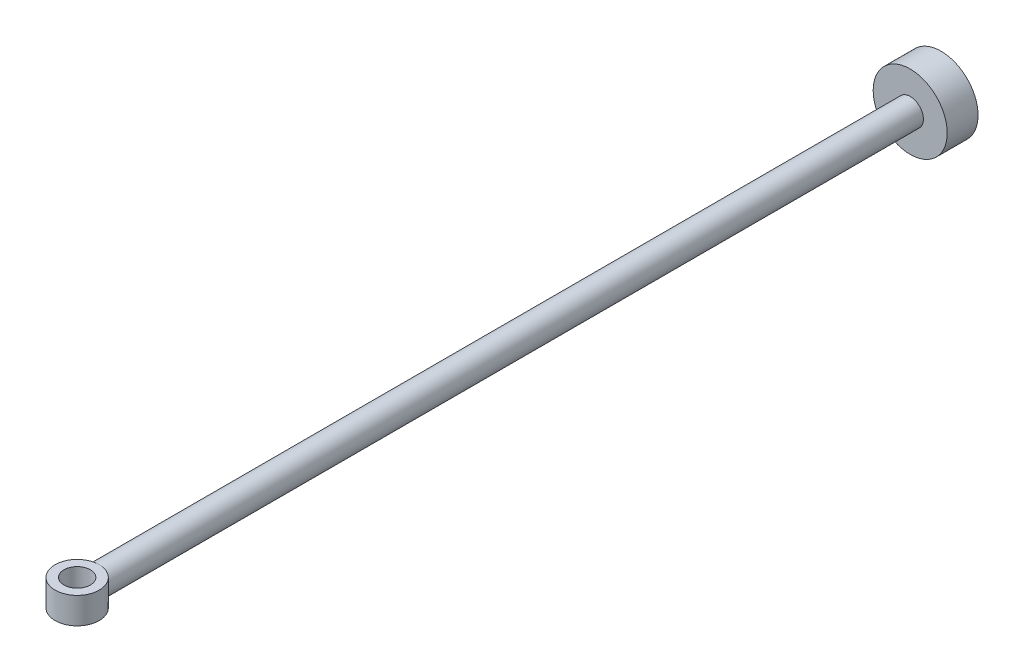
from build123d import *

# Parameters (mm, degrees)
ESQUISSE1_R             = 15
BOSS_EXTRU_1_DEPTH      = 925
ESQUISSE2_R             = 42
BOSS_EXTRU_2_DEPTH      = 35
ESQUISSE3_R             = 25
BOSS_EXTRU_4_DEPTH      = 15
ESQUISSE5_R             = 15
ENL_V_MAT_EXTRU_1_DEPTH = 60


with BuildPart() as part:
    # Esquisse1 → Boss.-Extru.1 (new body)
    with BuildSketch(Plane.XY):
        with Locations(Location((0, 0, 0), (0, 0, 180))):
            Circle(ESQUISSE1_R)
    extrude(amount=BOSS_EXTRU_1_DEPTH)

    # Esquisse2 → Boss.-Extru.2 (add)
    with BuildSketch(Plane(origin=(0, 0, 0), x_dir=(-1, 0, 0), z_dir=(0, 0, -1))):
        Circle(ESQUISSE2_R)
    extrude(amount=BOSS_EXTRU_2_DEPTH)

    # Esquisse3 → Boss.-Extru.4 (add, symmetric)
    with BuildSketch(Plane(origin=(0, 0, 0), x_dir=(1, 0, 0), z_dir=(0, 1, 0))):
        with Locations((0, -945)):
            Circle(ESQUISSE3_R)
    extrude(amount=BOSS_EXTRU_4_DEPTH, both=True)

    # Esquisse5 → Enl_v. mat.-Extru.1 (cut, symmetric)
    with BuildSketch(Plane.XZ.offset(15)):
        with Locations(Location((0, 945, 0), (0, 0, 270))):
            Circle(ESQUISSE5_R)
    extrude(amount=ENL_V_MAT_EXTRU_1_DEPTH, both=True, mode=Mode.SUBTRACT)


solid = part.part
